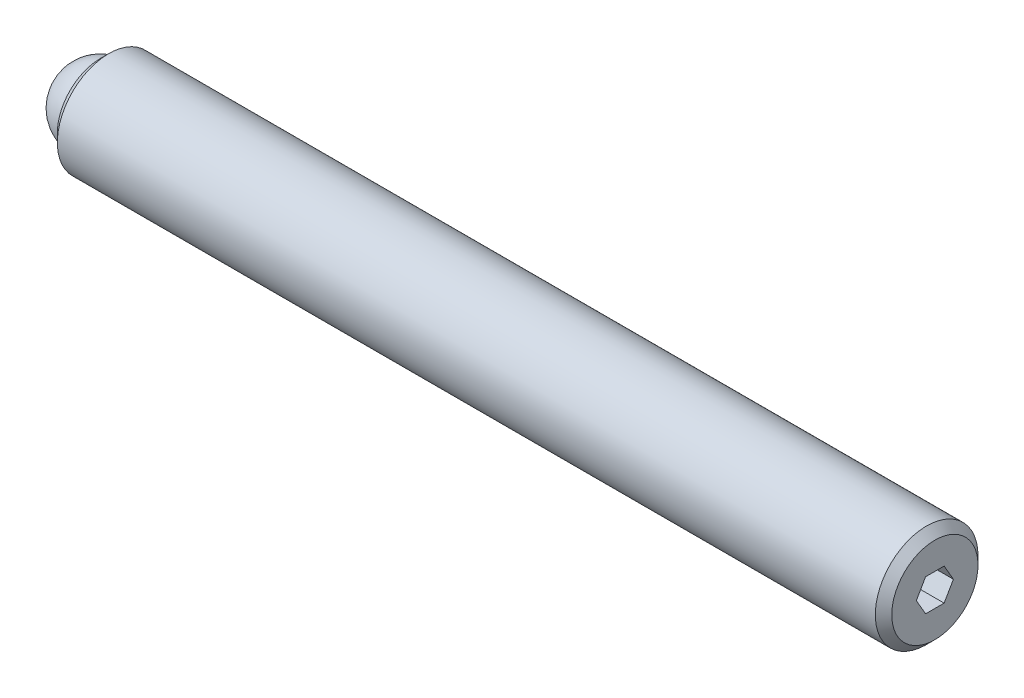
from build123d import *

# Parameters (mm, degrees)
SKETCH2_R           = 3.175
BOSS_EXTRUDE1_DEPTH = 51.59375
CHAMFER1_SIZE       = 0.508
CHAMFER2_SIZE       = 0.508
CUT_EXTRUDE2_DEPTH  = 2.286
SKETCH3_R           = 2.38125
CUT_EXTRUDE3_DEPTH  = 1.984375


with BuildPart() as part:
    # Sketch2 → Boss-Extrude1 (new body)
    with BuildSketch(Plane(origin=(0, 0, 0), x_dir=(0, 0, -1), z_dir=(1, 0, 0))):
        Circle(SKETCH2_R)
    extrude(amount=BOSS_EXTRUDE1_DEPTH)

    # Chamfer1
    chamfer1_edges = [part.edges().sort_by_distance(p)[0] for p in [
        (0, 0, 3.175),
    ]]
    chamfer(chamfer1_edges, length=CHAMFER1_SIZE)

    # Chamfer2
    chamfer2_edges = [part.edges().sort_by_distance(p)[0] for p in [
        (51.59375, 0, 3.175),
    ]]
    chamfer(chamfer2_edges, length=CHAMFER2_SIZE)

    # Sketch4 → Cut-Extrude2 (cut)
    with BuildSketch(Plane(origin=(51.59375, 0, 0), x_dir=(0, 0, -1), z_dir=(1, 0, 0))):
        Polygon((1.14567944, 0), (0.57283972, 0.9921875), (-0.57283972, 0.9921875), (-1.14567944, 0), (-0.57283972, -0.9921875), (0.57283972, -0.9921875), align=None)
    extrude(amount=-CUT_EXTRUDE2_DEPTH, mode=Mode.SUBTRACT)

    # Sketch3 → Cut-Extrude3 (cut)
    with BuildSketch(Plane.ZY):
        Circle(SKETCH3_R)
    extrude(amount=-CUT_EXTRUDE3_DEPTH, mode=Mode.SUBTRACT)


with BuildPart() as body_2:
    # Sketch5 → Revolve1 (revolve)
    with BuildSketch(Plane.ZY):
        with BuildLine():
            Line((0, 0), (0, -2.38125))
            ThreePointArc((0, -2.38125), (-2.38125, 0), (0, 2.38125))
            Line((0, 2.38125), (0, 0))
        make_face()
    revolve(axis=Axis((0, 0, 0), (0, 1, 0)))


solid = Compound([part.part, body_2.part])
